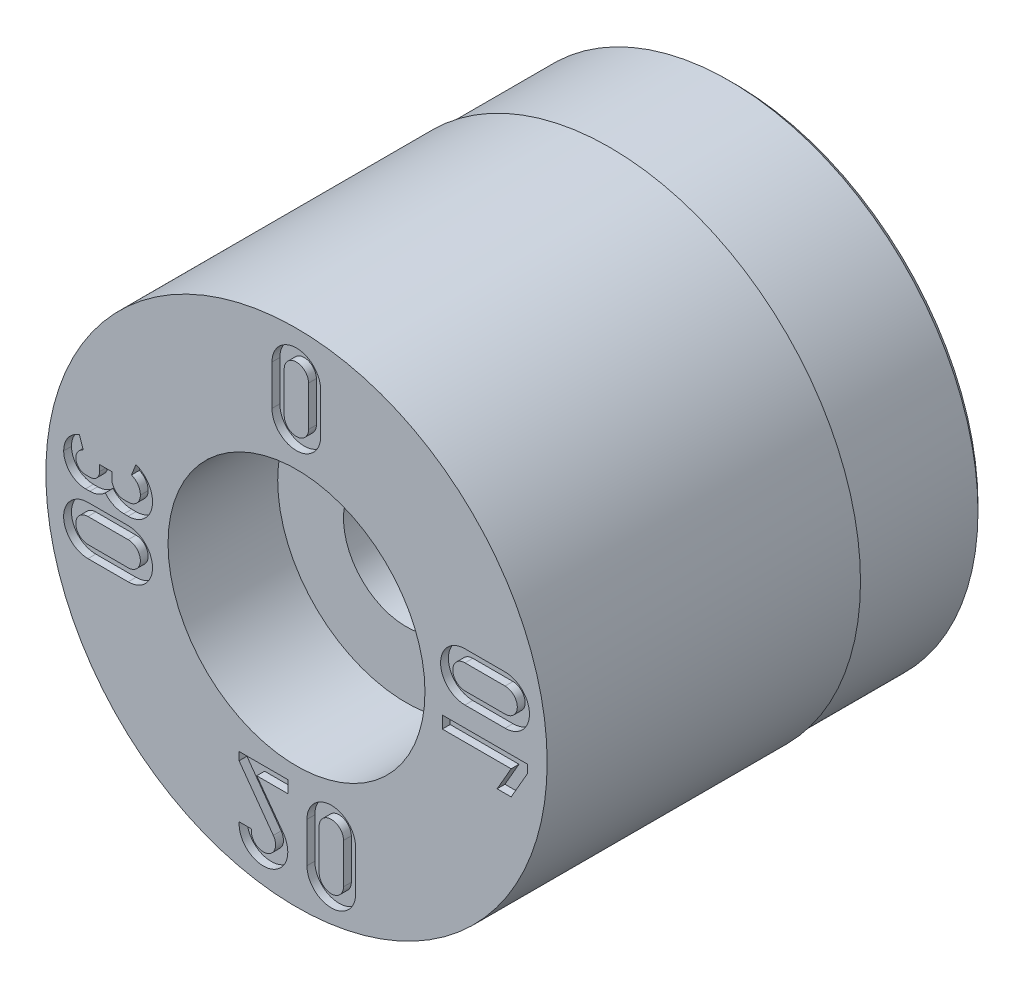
from build123d import *

# Parameters (mm, degrees)
SKETCH4_W          = 4
SKETCH4_H          = 1
CUT_EXTRUDE1_DEPTH = 0.25


with BuildPart() as part:
    # Sketch1 → Revolve1 (revolve)
    with BuildSketch(Plane(origin=(0, 0, 0), x_dir=(0, 0, -1), z_dir=(1, 0, 0)), mode=Mode.PRIVATE) as revolve1_sk:
        Polygon((0, 8), (0, 4.1), (3.5, 4.1), (3.5, 2), (14, 2), (14, 7.75), (13.75, 8), align=None)
    revolve(revolve1_sk.sketch.rotate(Axis((0, 0, 3.797909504), (0, 0, -1)), 90), axis=Axis((0, 0, 3.797909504), (0, 0, -1)))

    # Sketch4 → Cut-Revolve1 (revolve, cut)
    with BuildSketch(Plane(origin=(0, 0, 0), x_dir=(0, 0, -1), z_dir=(1, 0, 0)), mode=Mode.PRIVATE) as cut_revolve1_sk:
        with Locations((12, 8.435)):
            Rectangle(SKETCH4_W, SKETCH4_H)
    revolve(cut_revolve1_sk.sketch.rotate(Axis((0, 0, 0), (0, 0, -1)), 90), axis=Axis((0, 0, 0), (0, 0, -1)), mode=Mode.SUBTRACT)

    # Sketch2 → Cut-Extrude1 (cut)
    # profile 1 of 7: a face of its own
    with BuildSketch(Plane.XY):
        with BuildLine():
            Line((1.888013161, -6.688747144), (1.88812257, -5.406516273))
            ThreePointArc((1.88812257, -5.406516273), (1.110728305, -4.629171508), (0.333419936, -5.406602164))
            Line((0.333419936, -5.406602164), (0.333528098, -6.688878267))
            ThreePointArc((0.333528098, -6.688878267), (1.110836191, -7.466055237), (1.888013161, -6.688747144))
        make_face()
        with BuildLine():
            Line((0.722149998, -5.406569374), (0.72225816, -6.688845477))
            ThreePointArc((0.72225816, -6.688845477), (1.110803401, -7.077325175), (1.499283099, -6.688779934))
            Line((1.499283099, -6.688779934), (1.499392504, -5.406476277))
            ThreePointArc((1.499392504, -5.406476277), (1.110724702, -5.017901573), (0.722149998, -5.406569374))
        make_face(mode=Mode.SUBTRACT)
    # profile 2 of 7: a face of its own
    with BuildSketch(Plane.XY):
        with BuildLine():
            Line((-5.37164322, 0.506985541), (-5.50764233, 0.506997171))
            ThreePointArc((-5.50764233, 0.506997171), (-5.782319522, 0.620799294), (-5.896075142, 0.895495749))
            Line((-5.896075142, 0.895495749), (-5.896058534, 1.089744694))
            Line((-5.896058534, 1.089744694), (-6.2846798, 1.089777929))
            Line((-6.2846798, 1.089777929), (-6.284696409, 0.895576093))
            ThreePointArc((-6.284696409, 0.895576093), (-6.375755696, 0.675792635), (-6.595554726, 0.584770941))
            Line((-6.595554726, 0.584770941), (-6.731535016, 0.584782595))
            ThreePointArc((-6.731535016, 0.584782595), (-6.951240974, 0.675918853), (-7.042355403, 0.895633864))
            ThreePointArc((-7.042355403, 0.895633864), (-6.976845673, 1.099567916), (-6.804605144, 1.226901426))
            Line((-6.804605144, 1.226901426), (-6.928929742, 1.595084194))
            ThreePointArc((-6.928929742, 1.595084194), (-7.292379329, 1.326122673), (-7.430930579, 0.89572814))
            ThreePointArc((-7.430930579, 0.89572814), (-7.226153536, 0.40105566), (-6.731529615, 0.196161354))
            Line((-6.731529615, 0.196161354), (-6.595587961, 0.196149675))
            ThreePointArc((-6.595587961, 0.196149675), (-6.330114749, 0.248489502), (-6.104399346, 0.397714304))
            ThreePointArc((-6.104399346, 0.397714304), (-5.837113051, 0.191642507), (-5.50765963, 0.118375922))
            Line((-5.50765963, 0.118375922), (-5.371610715, 0.118364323))
            ThreePointArc((-5.371610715, 0.118364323), (-4.8221295, 0.345934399), (-4.594542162, 0.895408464))
            ThreePointArc((-4.594542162, 0.895408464), (-4.739279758, 1.365412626), (-5.123311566, 1.672613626))
            Line((-5.123311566, 1.672613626), (-5.265911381, 1.311270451))
            ThreePointArc((-5.265911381, 1.311270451), (-5.060463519, 1.146943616), (-4.983054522, 0.895507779))
            ThreePointArc((-4.983054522, 0.895507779), (-5.096883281, 0.620767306), (-5.37164322, 0.506985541))
        make_face()
    # profile 3 of 7: a face of its own
    with BuildSketch(Plane.XY):
        with BuildLine():
            Line((6.658073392, 1.828565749), (5.375828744, 1.828674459))
            ThreePointArc((5.375828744, 1.828674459), (4.598652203, 1.051381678), (5.375929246, 0.274189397))
            Line((5.375929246, 0.274189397), (6.658205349, 0.274298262))
            ThreePointArc((6.658205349, 0.274298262), (7.435273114, 1.051497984), (6.658073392, 1.828565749))
        make_face()
        with BuildLine():
            Line((5.375896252, 0.662810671), (6.658172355, 0.662919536))
            ThreePointArc((6.658172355, 0.662919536), (7.04665184, 1.05146499), (6.658106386, 1.439944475))
            Line((6.658106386, 1.439944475), (5.375802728, 1.440053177))
            ThreePointArc((5.375802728, 1.440053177), (4.987273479, 1.051385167), (5.375896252, 0.662810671))
        make_face(mode=Mode.SUBTRACT)
    # profile 4 of 7: a face of its own
    with BuildSketch(Plane.XY):
        Polygon((7.374340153, -0.362560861), (7.374361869, -0.618341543), (6.851236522, -1.528251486), (6.403103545, -1.528289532), (6.849756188, -0.751117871), (4.654459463, -0.751304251), (4.654426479, -0.362791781), align=None)
    # profile 5 of 7: a face of its own
    with BuildSketch(Plane.XY):
        with BuildLine():
            Line((-0.278135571, -5.002738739), (-0.278168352, -4.6141121))
            Line((-0.278168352, -4.6141121), (-1.832437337, -4.614243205))
            Line((-1.832437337, -4.614243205), (-1.832415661, -4.871220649))
            Line((-1.832415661, -4.871220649), (-0.739643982, -6.388078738))
            ThreePointArc((-0.739643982, -6.388078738), (-0.963786, -6.993075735), (-1.439267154, -6.556980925))
            Line((-1.439267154, -6.556980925), (-1.83009753, -6.557022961))
            ThreePointArc((-1.83009753, -6.557022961), (-0.84385292, -7.363122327), (-0.423857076, -6.160592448))
            Line((-0.423857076, -6.160592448), (-1.269054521, -5.002822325))
            Line((-1.269054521, -5.002822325), (-0.278135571, -5.002738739))
        make_face()
    # profile 6 of 7: a face of its own
    with BuildSketch(Plane.XY):
        with BuildLine():
            Line((-0.781861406, 6.675597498), (-0.781753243, 5.393352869))
            ThreePointArc((-0.781753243, 5.393352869), (-0.004460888, 4.616175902), (0.77273182, 5.393452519))
            Line((0.77273182, 5.393452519), (0.772841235, 6.67572864))
            ThreePointArc((0.772841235, 6.67572864), (-0.004575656, 7.453014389), (-0.781861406, 6.675597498))
        make_face()
        with BuildLine():
            Line((0.384110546, 5.393419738), (0.384002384, 6.675695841))
            ThreePointArc((0.384002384, 6.675695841), (-0.004542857, 7.064175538), (-0.393022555, 6.675630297))
            Line((-0.393022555, 6.675630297), (-0.39313196, 5.39332664))
            ThreePointArc((-0.39313196, 5.39332664), (-0.004464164, 5.004797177), (0.384110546, 5.393419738))
        make_face(mode=Mode.SUBTRACT)
    # profile 7 of 7: a face of its own
    with BuildSketch(Plane.XY):
        with BuildLine():
            Line((-6.654828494, -0.14103098), (-5.372583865, -0.141140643))
            ThreePointArc((-5.372583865, -0.141140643), (-4.595384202, -0.918429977), (-5.372677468, -1.695625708))
            Line((-5.372677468, -1.695625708), (-6.654961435, -1.695516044))
            ThreePointArc((-6.654961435, -1.695516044), (-7.432137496, -0.918207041), (-6.654828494, -0.14103098))
        make_face()
        with BuildLine():
            Line((-5.372695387, -1.307113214), (-6.654928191, -1.306785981))
            ThreePointArc((-6.654928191, -1.306785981), (-7.043407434, -0.918240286), (-6.654861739, -0.529761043))
            Line((-6.654861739, -0.529761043), (-5.372558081, -0.529653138))
            ThreePointArc((-5.372558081, -0.529653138), (-4.983896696, -0.918451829), (-5.372695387, -1.307113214))
        make_face(mode=Mode.SUBTRACT)
    extrude(amount=-CUT_EXTRUDE1_DEPTH, mode=Mode.SUBTRACT)


solid = part.part
